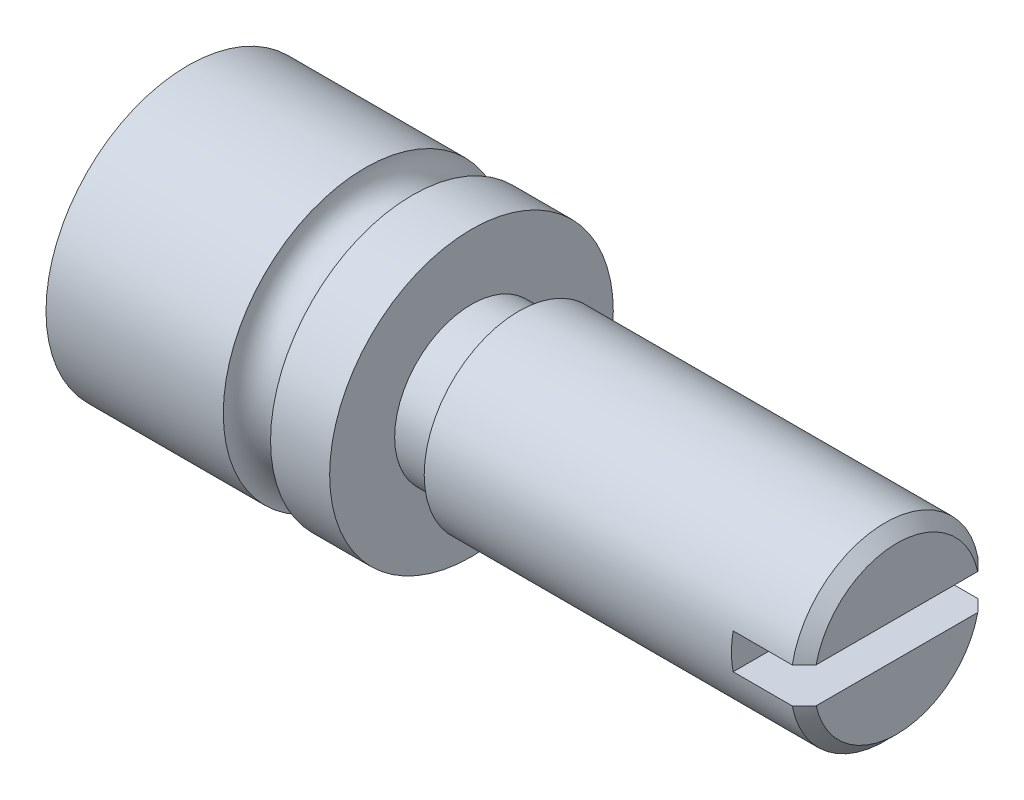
ISO-10303-21;
HEADER;
FILE_DESCRIPTION(('STEP AP214'),'2;1');
FILE_NAME('part.step','',(''),(''),'','','');
FILE_SCHEMA(('AUTOMOTIVE_DESIGN { 1 0 10303 214 1 1 1 1 }'));
ENDSEC;
DATA;
#1=APPLICATION_CONTEXT('core data for automotive mechanical design processes');
#2=APPLICATION_PROTOCOL_DEFINITION('international standard','automotive_design',2000,#1);
#3=PRODUCT_CONTEXT('',#1,'mechanical');
#4=PRODUCT('Part','Part','',(#3));
#5=PRODUCT_RELATED_PRODUCT_CATEGORY('part','',(#4));
#6=PRODUCT_DEFINITION_FORMATION('','',#4);
#7=PRODUCT_DEFINITION_CONTEXT('part definition',#1,'design');
#8=PRODUCT_DEFINITION('design','',#6,#7);
#9=PRODUCT_DEFINITION_SHAPE('','',#8);
#10=(LENGTH_UNIT() NAMED_UNIT(*) SI_UNIT(.MILLI.,.METRE.));
#11=(NAMED_UNIT(*) PLANE_ANGLE_UNIT() SI_UNIT($,.RADIAN.));
#12=(NAMED_UNIT(*) SI_UNIT($,.STERADIAN.) SOLID_ANGLE_UNIT());
#13=UNCERTAINTY_MEASURE_WITH_UNIT(LENGTH_MEASURE(1.E-05),#10,'distance_accuracy_value','');
#14=(GEOMETRIC_REPRESENTATION_CONTEXT(3) GLOBAL_UNCERTAINTY_ASSIGNED_CONTEXT((#13)) GLOBAL_UNIT_ASSIGNED_CONTEXT((#10,
#11,#12)) REPRESENTATION_CONTEXT('',''));
#15=CARTESIAN_POINT('',(0.,0.,0.));
#16=DIRECTION('',(0.,0.,1.));
#17=DIRECTION('',(1.,0.,0.));
#18=AXIS2_PLACEMENT_3D('',#15,#16,#17);
#19=CARTESIAN_POINT('',(18.,4.,0.));
#20=DIRECTION('',(-1.,0.,0.));
#21=DIRECTION('',(0.,0.,1.));
#22=AXIS2_PLACEMENT_3D('',#19,#20,#21);
#23=PLANE('',#22);
#24=CARTESIAN_POINT('',(18.,0.,0.));
#25=DIRECTION('',(-1.,0.,0.));
#26=DIRECTION('',(0.,0.,1.));
#27=AXIS2_PLACEMENT_3D('',#24,#25,#26);
#28=CIRCLE('',#27,3.50000000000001);
#29=CARTESIAN_POINT('',(18.,0.75,-3.41869858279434));
#30=VERTEX_POINT('',#29);
#31=CARTESIAN_POINT('',(18.,0.75,3.41869858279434));
#32=VERTEX_POINT('',#31);
#33=EDGE_CURVE('E143',#30,#32,#28,.F.);
#34=ORIENTED_EDGE('',*,*,#33,.T.);
#35=DIRECTION('',(0.,0.,-1.));
#36=VECTOR('',#35,1.);
#37=CARTESIAN_POINT('',(18.,0.75,0.));
#38=LINE('',#37,#36);
#39=EDGE_CURVE('E176',#32,#30,#38,.T.);
#40=ORIENTED_EDGE('',*,*,#39,.T.);
#41=EDGE_LOOP('',(#34,#40));
#42=FACE_BOUND('',#41,.T.);
#43=ADVANCED_FACE('F32',(#42),#23,.F.);
#44=CARTESIAN_POINT('',(17.5,0.,0.));
#45=DIRECTION('',(-1.,0.,0.));
#46=DIRECTION('',(0.,0.,1.));
#47=AXIS2_PLACEMENT_3D('',#44,#45,#46);
#48=CONICAL_SURFACE('',#47,4.,0.785398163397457);
#49=CARTESIAN_POINT('',(14.8204698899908,0.75,-6.63729029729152));
#50=CARTESIAN_POINT('',(15.0726824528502,0.75,-6.38345514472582));
#51=CARTESIAN_POINT('',(15.3248199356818,0.75,-6.12954521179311));
#52=CARTESIAN_POINT('',(15.8287436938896,0.75,-5.62154216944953));
#53=CARTESIAN_POINT('',(16.0805300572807,0.75,-5.36744914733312));
#54=CARTESIAN_POINT('',(16.583490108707,0.75,-4.85910839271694));
#55=CARTESIAN_POINT('',(16.8346641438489,0.75,-4.60486100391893));
#56=CARTESIAN_POINT('',(17.2109877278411,0.75,-4.22298317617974));
#57=CARTESIAN_POINT('',(17.3363748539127,0.75,-4.09558689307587));
#58=CARTESIAN_POINT('',(17.5869430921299,0.75,-3.84058302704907));
#59=CARTESIAN_POINT('',(17.7121241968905,0.75,-3.71297543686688));
#60=CARTESIAN_POINT('',(17.9624376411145,0.75,-3.45724382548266));
#61=CARTESIAN_POINT('',(18.0875694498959,0.75,-3.32911928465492));
#62=CARTESIAN_POINT('',(18.3374216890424,0.75,-3.07250094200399));
#63=CARTESIAN_POINT('',(18.4621421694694,0.75,-2.94400718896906));
#64=CARTESIAN_POINT('',(18.7108851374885,0.75,-2.68658876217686));
#65=CARTESIAN_POINT('',(18.8349081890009,0.75,-2.55766463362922));
#66=CARTESIAN_POINT('',(19.082137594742,0.75,-2.29892095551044));
#67=CARTESIAN_POINT('',(19.2053435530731,0.75,-2.16910102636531));
#68=CARTESIAN_POINT('',(19.3892670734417,0.75,-1.97311811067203));
#69=CARTESIAN_POINT('',(19.4505312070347,0.75,-1.90746844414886));
#70=CARTESIAN_POINT('',(19.5725543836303,0.75,-1.77571607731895));
#71=CARTESIAN_POINT('',(19.633313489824,0.75,-1.70961343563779));
#72=CARTESIAN_POINT('',(19.7540593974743,0.75,-1.57688540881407));
#73=CARTESIAN_POINT('',(19.8140472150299,0.75,-1.51026094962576));
#74=CARTESIAN_POINT('',(19.9330810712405,0.75,-1.37611643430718));
#75=CARTESIAN_POINT('',(19.9921266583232,0.75,-1.30859597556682));
#76=CARTESIAN_POINT('',(20.1090691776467,0.75,-1.17194139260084));
#77=CARTESIAN_POINT('',(20.1669583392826,0.75,-1.10280060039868));
#78=CARTESIAN_POINT('',(20.2803409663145,0.75,-0.962697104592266));
#79=CARTESIAN_POINT('',(20.335837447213,0.75,-0.891736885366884));
#80=CARTESIAN_POINT('',(20.4161754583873,0.75,-0.782796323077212));
#81=CARTESIAN_POINT('',(20.4425463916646,0.75,-0.745949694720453));
#82=CARTESIAN_POINT('',(20.4938284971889,0.75,-0.671283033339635));
#83=CARTESIAN_POINT('',(20.5187406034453,0.75,-0.633463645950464));
#84=CARTESIAN_POINT('',(20.5666567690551,0.75,-0.556369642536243));
#85=CARTESIAN_POINT('',(20.5896515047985,0.75,-0.517089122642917));
#86=CARTESIAN_POINT('',(20.6219376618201,0.75,-0.45692367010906));
#87=CARTESIAN_POINT('',(20.6323423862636,0.75,-0.43663783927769));
#88=CARTESIAN_POINT('',(20.6522451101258,0.75,-0.395612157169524));
#89=CARTESIAN_POINT('',(20.6617425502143,0.75,-0.374872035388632));
#90=CARTESIAN_POINT('',(20.6706997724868,0.75,-0.353891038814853));
#91=B_SPLINE_CURVE_WITH_KNOTS('',3,(#49,#50,#51,#52,#53,#54,#55,#56,#57,#58,#59,#60,#61,#62,#63,
#64,#65,#66,#67,#68,#69,#70,#71,#72,#73,#74,#75,#76,#77,#78,#79,#80,#81,#82,#83,#84,#85,#86,#87,
#88,#89,#90),.UNSPECIFIED.,.F.,.F.,(4,2,2,2,2,2,2,2,2,2,2,2,2,2,2,2,2,2,2,2,4),(0.,
1.07349499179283,2.14663819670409,3.21881794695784,3.75506930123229,4.29133947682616,
4.8286142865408,5.36582109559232,5.90250183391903,6.43942596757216,6.70880970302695,
6.97815920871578,7.24710726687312,7.51618056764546,7.78668361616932,8.05683513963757,
8.19274365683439,8.32856418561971,8.465010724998,8.53338611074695,8.60180338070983),.UNSPECIFIED.);
#92=CARTESIAN_POINT('',(17.5,0.75,-3.92905841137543));
#93=VERTEX_POINT('',#92);
#94=EDGE_CURVE('E106',#93,#30,#91,.T.);
#95=ORIENTED_EDGE('',*,*,#94,.F.);
#96=CARTESIAN_POINT('',(17.5,0.,0.));
#97=DIRECTION('',(-1.,0.,0.));
#98=DIRECTION('',(0.,0.,1.));
#99=AXIS2_PLACEMENT_3D('',#96,#97,#98);
#100=CIRCLE('',#99,4.);
#101=CARTESIAN_POINT('',(17.5,0.75,3.92905841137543));
#102=VERTEX_POINT('',#101);
#103=EDGE_CURVE('E147',#102,#93,#100,.T.);
#104=ORIENTED_EDGE('',*,*,#103,.F.);
#105=CARTESIAN_POINT('',(20.6706997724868,0.75,0.353891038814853));
#106=CARTESIAN_POINT('',(20.6583375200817,0.75,0.382818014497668));
#107=CARTESIAN_POINT('',(20.6449688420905,0.75,0.411286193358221));
#108=CARTESIAN_POINT('',(20.6166283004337,0.75,0.467374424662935));
#109=CARTESIAN_POINT('',(20.601658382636,0.75,0.494995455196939));
#110=CARTESIAN_POINT('',(20.5705517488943,0.75,0.549425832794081));
#111=CARTESIAN_POINT('',(20.5544196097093,0.75,0.576237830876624));
#112=CARTESIAN_POINT('',(20.5211968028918,0.75,0.629271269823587));
#113=CARTESIAN_POINT('',(20.5041058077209,0.75,0.655492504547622));
#114=CARTESIAN_POINT('',(20.4519036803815,0.75,0.733128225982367));
#115=CARTESIAN_POINT('',(20.4156933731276,0.75,0.783801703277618));
#116=CARTESIAN_POINT('',(20.3413482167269,0.75,0.88379009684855));
#117=CARTESIAN_POINT('',(20.303211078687,0.75,0.933103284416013));
#118=CARTESIAN_POINT('',(20.2262090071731,0.75,1.02999765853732));
#119=CARTESIAN_POINT('',(20.1873625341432,0.75,1.07759357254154));
#120=CARTESIAN_POINT('',(20.1087759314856,0.75,1.17204355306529));
#121=CARTESIAN_POINT('',(20.0690357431,0.75,1.21889757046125));
#122=CARTESIAN_POINT('',(19.9488290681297,0.75,1.35864354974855));
#123=CARTESIAN_POINT('',(19.8673926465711,0.75,1.45069954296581));
#124=CARTESIAN_POINT('',(19.7030172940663,0.75,1.63346776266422));
#125=CARTESIAN_POINT('',(19.6200781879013,0.75,1.72417983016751));
#126=CARTESIAN_POINT('',(19.4532473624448,0.75,1.90470047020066));
#127=CARTESIAN_POINT('',(19.3693557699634,0.75,1.99450916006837));
#128=CARTESIAN_POINT('',(19.2004629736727,0.75,2.17400447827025));
#129=CARTESIAN_POINT('',(19.1154582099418,0.75,2.26368774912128));
#130=CARTESIAN_POINT('',(18.9449802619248,0.75,2.44261314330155));
#131=CARTESIAN_POINT('',(18.8595070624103,0.75,2.53185525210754));
#132=CARTESIAN_POINT('',(18.6026214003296,0.75,2.79905907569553));
#133=CARTESIAN_POINT('',(18.4307060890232,0.75,2.97653713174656));
#134=CARTESIAN_POINT('',(18.1882611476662,0.75,3.22573707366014));
#135=CARTESIAN_POINT('',(18.1180532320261,0.75,3.2977730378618));
#136=CARTESIAN_POINT('',(17.9776326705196,0.75,3.44162998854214));
#137=CARTESIAN_POINT('',(17.9074201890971,0.75,3.51345113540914));
#138=CARTESIAN_POINT('',(17.5878474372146,0.75,3.83994586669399));
#139=CARTESIAN_POINT('',(17.3379780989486,0.75,4.09412103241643));
#140=CARTESIAN_POINT('',(16.8376178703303,0.75,4.60186117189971));
#141=CARTESIAN_POINT('',(16.5871269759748,0.75,4.85542614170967));
#142=CARTESIAN_POINT('',(16.0840900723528,0.75,5.36385746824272));
#143=CARTESIAN_POINT('',(15.831541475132,0.75,5.61872126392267));
#144=CARTESIAN_POINT('',(15.3261765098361,0.75,6.12817804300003));
#145=CARTESIAN_POINT('',(15.0733601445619,0.75,6.38277102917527));
#146=CARTESIAN_POINT('',(14.8204698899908,0.75,6.63729029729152));
#147=B_SPLINE_CURVE_WITH_KNOTS('',3,(#105,#106,#107,#108,#109,#110,#111,#112,#113,#114,#115,
#116,#117,#118,#119,#120,#121,#122,#123,#124,#125,#126,#127,#128,#129,#130,#131,#132,#133,#134,
#135,#136,#137,#138,#139,#140,#141,#142,#143,#144,#145,#146),.UNSPECIFIED.,.F.,.F.,(4,2,2,2,2,2,
2,2,2,2,2,2,2,2,2,2,2,2,2,2,4),(0.,0.0943161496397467,0.188518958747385,0.282369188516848,
0.376251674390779,0.563017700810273,0.750011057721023,0.934304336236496,1.11860976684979,
1.48729751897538,1.85602854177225,2.22471103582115,2.59541110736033,2.96612330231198,
3.70738720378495,4.00915700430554,4.31047501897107,5.37975152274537,6.44903493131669,
7.52543010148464,8.60181412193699),.UNSPECIFIED.);
#148=EDGE_CURVE('E107',#32,#102,#147,.T.);
#149=ORIENTED_EDGE('',*,*,#148,.F.);
#150=ORIENTED_EDGE('',*,*,#33,.F.);
#151=EDGE_LOOP('',(#95,#104,#149,#150));
#152=FACE_BOUND('',#151,.T.);
#153=ADVANCED_FACE('F186',(#152),#48,.T.);
#154=CARTESIAN_POINT('',(-90.6824561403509,0.,0.));
#155=DIRECTION('',(-1.,0.,0.));
#156=DIRECTION('',(0.,0.,1.));
#157=AXIS2_PLACEMENT_3D('',#154,#155,#156);
#158=CYLINDRICAL_SURFACE('',#157,6.);
#159=CARTESIAN_POINT('',(-2.49999999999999,0.,0.));
#160=DIRECTION('',(-1.,0.,0.));
#161=DIRECTION('',(0.,0.,1.));
#162=AXIS2_PLACEMENT_3D('',#159,#160,#161);
#163=CIRCLE('',#162,6.);
#164=CARTESIAN_POINT('',(-2.49999999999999,0.,6.));
#165=VERTEX_POINT('',#164);
#166=EDGE_CURVE('E151',#165,#165,#163,.T.);
#167=ORIENTED_EDGE('',*,*,#166,.F.);
#168=EDGE_LOOP('',(#167));
#169=FACE_BOUND('',#168,.T.);
#170=CARTESIAN_POINT('',(0.,0.,0.));
#171=DIRECTION('',(-1.,0.,0.));
#172=DIRECTION('',(0.,0.,1.));
#173=AXIS2_PLACEMENT_3D('',#170,#171,#172);
#174=CIRCLE('',#173,6.);
#175=CARTESIAN_POINT('',(0.,0.,6.));
#176=VERTEX_POINT('',#175);
#177=EDGE_CURVE('E171',#176,#176,#174,.T.);
#178=ORIENTED_EDGE('',*,*,#177,.T.);
#179=EDGE_LOOP('',(#178));
#180=FACE_BOUND('',#179,.T.);
#181=ADVANCED_FACE('F34',(#169,#180),#158,.T.);
#182=CARTESIAN_POINT('',(-3.49999999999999,0.,0.));
#183=DIRECTION('',(-1.,0.,0.));
#184=DIRECTION('',(0.,0.,1.));
#185=AXIS2_PLACEMENT_3D('',#182,#183,#184);
#186=TOROIDAL_SURFACE('',#185,6.,1.);
#187=CARTESIAN_POINT('',(-4.49999999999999,0.,0.));
#188=DIRECTION('',(-1.,0.,0.));
#189=DIRECTION('',(0.,0.,1.));
#190=AXIS2_PLACEMENT_3D('',#187,#188,#189);
#191=CIRCLE('',#190,6.);
#192=CARTESIAN_POINT('',(-4.49999999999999,0.,6.));
#193=VERTEX_POINT('',#192);
#194=EDGE_CURVE('E154',#193,#193,#191,.T.);
#195=ORIENTED_EDGE('',*,*,#194,.F.);
#196=EDGE_LOOP('',(#195));
#197=FACE_BOUND('',#196,.T.);
#198=ORIENTED_EDGE('',*,*,#166,.T.);
#199=EDGE_LOOP('',(#198));
#200=FACE_BOUND('',#199,.T.);
#201=ADVANCED_FACE('F215',(#197,#200),#186,.F.);
#202=CARTESIAN_POINT('',(-90.6824561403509,0.,0.));
#203=DIRECTION('',(-1.,0.,0.));
#204=DIRECTION('',(0.,0.,1.));
#205=AXIS2_PLACEMENT_3D('',#202,#203,#204);
#206=CYLINDRICAL_SURFACE('',#205,6.);
#207=CARTESIAN_POINT('',(-12.,0.,0.));
#208=DIRECTION('',(-1.,0.,0.));
#209=DIRECTION('',(0.,0.,1.));
#210=AXIS2_PLACEMENT_3D('',#207,#208,#209);
#211=CIRCLE('',#210,6.);
#212=CARTESIAN_POINT('',(-12.,0.,6.));
#213=VERTEX_POINT('',#212);
#214=EDGE_CURVE('E158',#213,#213,#211,.T.);
#215=ORIENTED_EDGE('',*,*,#214,.F.);
#216=EDGE_LOOP('',(#215));
#217=FACE_BOUND('',#216,.T.);
#218=ORIENTED_EDGE('',*,*,#194,.T.);
#219=EDGE_LOOP('',(#218));
#220=FACE_BOUND('',#219,.T.);
#221=ADVANCED_FACE('F210',(#217,#220),#206,.T.);
#222=CARTESIAN_POINT('',(4.99999999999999,0.,0.));
#223=DIRECTION('',(-1.,0.,0.));
#224=DIRECTION('',(0.,1.,0.));
#225=AXIS2_PLACEMENT_3D('',#222,#223,#224);
#226=SPHERICAL_SURFACE('',#225,18.0277563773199);
#227=ORIENTED_EDGE('',*,*,#214,.T.);
#228=EDGE_LOOP('',(#227));
#229=FACE_BOUND('',#228,.T.);
#230=ADVANCED_FACE('F204',(#229),#226,.T.);
#231=CARTESIAN_POINT('',(18.,-0.75,3.41869858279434));
#232=VERTEX_POINT('',#231);
#233=CARTESIAN_POINT('',(18.,-0.75,-3.41869858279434));
#234=VERTEX_POINT('',#233);
#235=EDGE_CURVE('E140',#232,#234,#28,.F.);
#236=ORIENTED_EDGE('',*,*,#235,.T.);
#237=DIRECTION('',(0.,0.,1.));
#238=VECTOR('',#237,1.);
#239=CARTESIAN_POINT('',(18.,-0.75,0.));
#240=LINE('',#239,#238);
#241=EDGE_CURVE('E96',#234,#232,#240,.T.);
#242=ORIENTED_EDGE('',*,*,#241,.T.);
#243=EDGE_LOOP('',(#236,#242));
#244=FACE_BOUND('',#243,.T.);
#245=ADVANCED_FACE('F198',(#244),#23,.F.);
#246=CARTESIAN_POINT('',(-90.6824561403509,0.,0.));
#247=DIRECTION('',(-1.,0.,0.));
#248=DIRECTION('',(0.,0.,1.));
#249=AXIS2_PLACEMENT_3D('',#246,#247,#248);
#250=CYLINDRICAL_SURFACE('',#249,4.);
#251=CARTESIAN_POINT('',(15.,0.,0.));
#252=DIRECTION('',(-1.,0.,0.));
#253=DIRECTION('',(0.,0.,1.));
#254=AXIS2_PLACEMENT_3D('',#251,#252,#253);
#255=CIRCLE('',#254,4.);
#256=CARTESIAN_POINT('',(15.,-0.75,3.92905841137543));
#257=VERTEX_POINT('',#256);
#258=CARTESIAN_POINT('',(15.,0.75,3.92905841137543));
#259=VERTEX_POINT('',#258);
#260=EDGE_CURVE('E11',#257,#259,#255,.T.);
#261=ORIENTED_EDGE('',*,*,#260,.T.);
#262=DIRECTION('',(-1.,0.,0.));
#263=VECTOR('',#262,1.);
#264=CARTESIAN_POINT('',(-90.6824561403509,0.75,3.92905841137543));
#265=LINE('',#264,#263);
#266=EDGE_CURVE('E95',#259,#102,#265,.F.);
#267=ORIENTED_EDGE('',*,*,#266,.T.);
#268=ORIENTED_EDGE('',*,*,#103,.T.);
#269=DIRECTION('',(-1.,0.,0.));
#270=VECTOR('',#269,1.);
#271=CARTESIAN_POINT('',(-90.6824561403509,0.75,-3.92905841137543));
#272=LINE('',#271,#270);
#273=CARTESIAN_POINT('',(15.,0.75,-3.92905841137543));
#274=VERTEX_POINT('',#273);
#275=EDGE_CURVE('E55',#93,#274,#272,.T.);
#276=ORIENTED_EDGE('',*,*,#275,.T.);
#277=CARTESIAN_POINT('',(15.,-0.75,-3.92905841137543));
#278=VERTEX_POINT('',#277);
#279=EDGE_CURVE('E36',#274,#278,#255,.T.);
#280=ORIENTED_EDGE('',*,*,#279,.T.);
#281=DIRECTION('',(-1.,0.,0.));
#282=VECTOR('',#281,1.);
#283=CARTESIAN_POINT('',(-90.6824561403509,-0.75,-3.92905841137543));
#284=LINE('',#283,#282);
#285=CARTESIAN_POINT('',(17.5,-0.75,-3.92905841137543));
#286=VERTEX_POINT('',#285);
#287=EDGE_CURVE('E85',#278,#286,#284,.F.);
#288=ORIENTED_EDGE('',*,*,#287,.T.);
#289=CARTESIAN_POINT('',(17.5,-0.75,3.92905841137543));
#290=VERTEX_POINT('',#289);
#291=EDGE_CURVE('E150',#286,#290,#100,.T.);
#292=ORIENTED_EDGE('',*,*,#291,.T.);
#293=DIRECTION('',(-1.,0.,0.));
#294=VECTOR('',#293,1.);
#295=CARTESIAN_POINT('',(-90.6824561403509,-0.75,3.92905841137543));
#296=LINE('',#295,#294);
#297=EDGE_CURVE('E47',#290,#257,#296,.T.);
#298=ORIENTED_EDGE('',*,*,#297,.T.);
#299=EDGE_LOOP('',(#261,#267,#268,#276,#280,#288,#292,#298));
#300=FACE_BOUND('',#299,.T.);
#301=CARTESIAN_POINT('',(2.,0.,0.));
#302=DIRECTION('',(-1.,0.,0.));
#303=DIRECTION('',(0.,0.,1.));
#304=AXIS2_PLACEMENT_3D('',#301,#302,#303);
#305=CIRCLE('',#304,4.);
#306=CARTESIAN_POINT('',(2.,0.,4.));
#307=VERTEX_POINT('',#306);
#308=EDGE_CURVE('E162',#307,#307,#305,.T.);
#309=ORIENTED_EDGE('',*,*,#308,.F.);
#310=EDGE_LOOP('',(#309));
#311=FACE_BOUND('',#310,.T.);
#312=ADVANCED_FACE('F103',(#300,#311),#250,.T.);
#313=CARTESIAN_POINT('',(2.,3.25,0.));
#314=DIRECTION('',(1.,0.,0.));
#315=DIRECTION('',(0.,0.,-1.));
#316=AXIS2_PLACEMENT_3D('',#313,#314,#315);
#317=PLANE('',#316);
#318=CARTESIAN_POINT('',(2.,0.,0.));
#319=DIRECTION('',(-1.,0.,0.));
#320=DIRECTION('',(0.,0.,1.));
#321=AXIS2_PLACEMENT_3D('',#318,#319,#320);
#322=CIRCLE('',#321,3.25);
#323=CARTESIAN_POINT('',(2.,0.,3.25));
#324=VERTEX_POINT('',#323);
#325=EDGE_CURVE('E165',#324,#324,#322,.T.);
#326=ORIENTED_EDGE('',*,*,#325,.F.);
#327=EDGE_LOOP('',(#326));
#328=FACE_BOUND('',#327,.T.);
#329=ORIENTED_EDGE('',*,*,#308,.T.);
#330=EDGE_LOOP('',(#329));
#331=FACE_BOUND('',#330,.T.);
#332=ADVANCED_FACE('F209',(#328,#331),#317,.F.);
#333=CARTESIAN_POINT('',(-90.6824561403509,0.,0.));
#334=DIRECTION('',(-1.,0.,0.));
#335=DIRECTION('',(0.,0.,1.));
#336=AXIS2_PLACEMENT_3D('',#333,#334,#335);
#337=CYLINDRICAL_SURFACE('',#336,3.25);
#338=CARTESIAN_POINT('',(0.,0.,0.));
#339=DIRECTION('',(-1.,0.,0.));
#340=DIRECTION('',(0.,0.,1.));
#341=AXIS2_PLACEMENT_3D('',#338,#339,#340);
#342=CIRCLE('',#341,3.25);
#343=CARTESIAN_POINT('',(0.,0.,3.25));
#344=VERTEX_POINT('',#343);
#345=EDGE_CURVE('E168',#344,#344,#342,.T.);
#346=ORIENTED_EDGE('',*,*,#345,.F.);
#347=EDGE_LOOP('',(#346));
#348=FACE_BOUND('',#347,.T.);
#349=ORIENTED_EDGE('',*,*,#325,.T.);
#350=EDGE_LOOP('',(#349));
#351=FACE_BOUND('',#350,.T.);
#352=ADVANCED_FACE('F191',(#348,#351),#337,.T.);
#353=CARTESIAN_POINT('',(0.,6.,0.));
#354=DIRECTION('',(-1.,0.,0.));
#355=DIRECTION('',(0.,0.,1.));
#356=AXIS2_PLACEMENT_3D('',#353,#354,#355);
#357=PLANE('',#356);
#358=ORIENTED_EDGE('',*,*,#177,.F.);
#359=EDGE_LOOP('',(#358));
#360=FACE_BOUND('',#359,.T.);
#361=ORIENTED_EDGE('',*,*,#345,.T.);
#362=EDGE_LOOP('',(#361));
#363=FACE_BOUND('',#362,.T.);
#364=ADVANCED_FACE('F185',(#360,#363),#357,.F.);
#365=CARTESIAN_POINT('',(20.6706997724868,-0.75,-0.353891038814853));
#366=CARTESIAN_POINT('',(20.6583375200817,-0.75,-0.382818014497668));
#367=CARTESIAN_POINT('',(20.6449688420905,-0.75,-0.411286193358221));
#368=CARTESIAN_POINT('',(20.6166283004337,-0.75,-0.467374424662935));
#369=CARTESIAN_POINT('',(20.601658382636,-0.75,-0.494995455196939));
#370=CARTESIAN_POINT('',(20.5705517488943,-0.75,-0.549425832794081));
#371=CARTESIAN_POINT('',(20.5544196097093,-0.75,-0.576237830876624));
#372=CARTESIAN_POINT('',(20.5211968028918,-0.75,-0.629271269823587));
#373=CARTESIAN_POINT('',(20.5041058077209,-0.75,-0.655492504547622));
#374=CARTESIAN_POINT('',(20.4519036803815,-0.75,-0.733128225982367));
#375=CARTESIAN_POINT('',(20.4156933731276,-0.75,-0.783801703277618));
#376=CARTESIAN_POINT('',(20.3413482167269,-0.75,-0.88379009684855));
#377=CARTESIAN_POINT('',(20.303211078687,-0.75,-0.933103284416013));
#378=CARTESIAN_POINT('',(20.2262090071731,-0.75,-1.02999765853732));
#379=CARTESIAN_POINT('',(20.1873625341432,-0.75,-1.07759357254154));
#380=CARTESIAN_POINT('',(20.1087759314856,-0.75,-1.17204355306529));
#381=CARTESIAN_POINT('',(20.0690357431,-0.75,-1.21889757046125));
#382=CARTESIAN_POINT('',(19.9488290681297,-0.75,-1.35864354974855));
#383=CARTESIAN_POINT('',(19.8673926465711,-0.75,-1.45069954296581));
#384=CARTESIAN_POINT('',(19.7030172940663,-0.75,-1.63346776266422));
#385=CARTESIAN_POINT('',(19.6200781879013,-0.75,-1.72417983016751));
#386=CARTESIAN_POINT('',(19.4532473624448,-0.75,-1.90470047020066));
#387=CARTESIAN_POINT('',(19.3693557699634,-0.75,-1.99450916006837));
#388=CARTESIAN_POINT('',(19.2004629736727,-0.75,-2.17400447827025));
#389=CARTESIAN_POINT('',(19.1154582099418,-0.75,-2.26368774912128));
#390=CARTESIAN_POINT('',(18.9449802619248,-0.75,-2.44261314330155));
#391=CARTESIAN_POINT('',(18.8595070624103,-0.75,-2.53185525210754));
#392=CARTESIAN_POINT('',(18.6026214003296,-0.75,-2.79905907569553));
#393=CARTESIAN_POINT('',(18.4307060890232,-0.75,-2.97653713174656));
#394=CARTESIAN_POINT('',(18.1882611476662,-0.75,-3.22573707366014));
#395=CARTESIAN_POINT('',(18.1180532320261,-0.75,-3.2977730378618));
#396=CARTESIAN_POINT('',(17.9776326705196,-0.75,-3.44162998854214));
#397=CARTESIAN_POINT('',(17.9074201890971,-0.75,-3.51345113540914));
#398=CARTESIAN_POINT('',(17.5878474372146,-0.75,-3.83994586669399));
#399=CARTESIAN_POINT('',(17.3379780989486,-0.75,-4.09412103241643));
#400=CARTESIAN_POINT('',(16.8376178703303,-0.75,-4.60186117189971));
#401=CARTESIAN_POINT('',(16.5871269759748,-0.75,-4.85542614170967));
#402=CARTESIAN_POINT('',(16.0840900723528,-0.75,-5.36385746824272));
#403=CARTESIAN_POINT('',(15.831541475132,-0.75,-5.61872126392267));
#404=CARTESIAN_POINT('',(15.3261765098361,-0.75,-6.12817804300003));
#405=CARTESIAN_POINT('',(15.0733601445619,-0.75,-6.38277102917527));
#406=CARTESIAN_POINT('',(14.8204698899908,-0.75,-6.63729029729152));
#407=B_SPLINE_CURVE_WITH_KNOTS('',3,(#365,#366,#367,#368,#369,#370,#371,#372,#373,#374,#375,
#376,#377,#378,#379,#380,#381,#382,#383,#384,#385,#386,#387,#388,#389,#390,#391,#392,#393,#394,
#395,#396,#397,#398,#399,#400,#401,#402,#403,#404,#405,#406),.UNSPECIFIED.,.F.,.F.,(4,2,2,2,2,2,
2,2,2,2,2,2,2,2,2,2,2,2,2,2,4),(0.,0.0943161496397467,0.188518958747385,0.282369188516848,
0.376251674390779,0.563017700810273,0.750011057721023,0.934304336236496,1.11860976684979,
1.48729751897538,1.85602854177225,2.22471103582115,2.59541110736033,2.96612330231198,
3.70738720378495,4.00915700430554,4.31047501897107,5.37975152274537,6.44903493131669,
7.52543010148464,8.60181412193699),.UNSPECIFIED.);
#408=EDGE_CURVE('E90',#234,#286,#407,.T.);
#409=ORIENTED_EDGE('',*,*,#408,.F.);
#410=ORIENTED_EDGE('',*,*,#235,.F.);
#411=CARTESIAN_POINT('',(14.8204698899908,-0.75,6.63729029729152));
#412=CARTESIAN_POINT('',(15.0726824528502,-0.75,6.38345514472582));
#413=CARTESIAN_POINT('',(15.3248199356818,-0.75,6.12954521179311));
#414=CARTESIAN_POINT('',(15.8287436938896,-0.75,5.62154216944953));
#415=CARTESIAN_POINT('',(16.0805300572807,-0.75,5.36744914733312));
#416=CARTESIAN_POINT('',(16.583490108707,-0.75,4.85910839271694));
#417=CARTESIAN_POINT('',(16.8346641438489,-0.75,4.60486100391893));
#418=CARTESIAN_POINT('',(17.2109877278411,-0.75,4.22298317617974));
#419=CARTESIAN_POINT('',(17.3363748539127,-0.75,4.09558689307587));
#420=CARTESIAN_POINT('',(17.5869430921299,-0.75,3.84058302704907));
#421=CARTESIAN_POINT('',(17.7121241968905,-0.75,3.71297543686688));
#422=CARTESIAN_POINT('',(17.9624376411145,-0.75,3.45724382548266));
#423=CARTESIAN_POINT('',(18.0875694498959,-0.75,3.32911928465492));
#424=CARTESIAN_POINT('',(18.3374216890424,-0.75,3.07250094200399));
#425=CARTESIAN_POINT('',(18.4621421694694,-0.75,2.94400718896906));
#426=CARTESIAN_POINT('',(18.7108851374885,-0.75,2.68658876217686));
#427=CARTESIAN_POINT('',(18.8349081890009,-0.75,2.55766463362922));
#428=CARTESIAN_POINT('',(19.082137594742,-0.75,2.29892095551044));
#429=CARTESIAN_POINT('',(19.2053435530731,-0.75,2.16910102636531));
#430=CARTESIAN_POINT('',(19.3892670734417,-0.75,1.97311811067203));
#431=CARTESIAN_POINT('',(19.4505312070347,-0.75,1.90746844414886));
#432=CARTESIAN_POINT('',(19.5725543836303,-0.75,1.77571607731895));
#433=CARTESIAN_POINT('',(19.633313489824,-0.75,1.70961343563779));
#434=CARTESIAN_POINT('',(19.7540593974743,-0.75,1.57688540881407));
#435=CARTESIAN_POINT('',(19.8140472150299,-0.75,1.51026094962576));
#436=CARTESIAN_POINT('',(19.9330810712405,-0.75,1.37611643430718));
#437=CARTESIAN_POINT('',(19.9921266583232,-0.75,1.30859597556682));
#438=CARTESIAN_POINT('',(20.1090691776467,-0.75,1.17194139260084));
#439=CARTESIAN_POINT('',(20.1669583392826,-0.75,1.10280060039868));
#440=CARTESIAN_POINT('',(20.2803409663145,-0.75,0.962697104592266));
#441=CARTESIAN_POINT('',(20.335837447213,-0.75,0.891736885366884));
#442=CARTESIAN_POINT('',(20.4161754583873,-0.75,0.782796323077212));
#443=CARTESIAN_POINT('',(20.4425463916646,-0.75,0.745949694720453));
#444=CARTESIAN_POINT('',(20.4938284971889,-0.75,0.671283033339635));
#445=CARTESIAN_POINT('',(20.5187406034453,-0.75,0.633463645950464));
#446=CARTESIAN_POINT('',(20.5666567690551,-0.75,0.556369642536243));
#447=CARTESIAN_POINT('',(20.5896515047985,-0.75,0.517089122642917));
#448=CARTESIAN_POINT('',(20.6219376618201,-0.75,0.45692367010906));
#449=CARTESIAN_POINT('',(20.6323423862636,-0.75,0.43663783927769));
#450=CARTESIAN_POINT('',(20.6522451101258,-0.75,0.395612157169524));
#451=CARTESIAN_POINT('',(20.6617425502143,-0.75,0.374872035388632));
#452=CARTESIAN_POINT('',(20.6706997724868,-0.75,0.353891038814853));
#453=B_SPLINE_CURVE_WITH_KNOTS('',3,(#411,#412,#413,#414,#415,#416,#417,#418,#419,#420,#421,
#422,#423,#424,#425,#426,#427,#428,#429,#430,#431,#432,#433,#434,#435,#436,#437,#438,#439,#440,
#441,#442,#443,#444,#445,#446,#447,#448,#449,#450,#451,#452),.UNSPECIFIED.,.F.,.F.,(4,2,2,2,2,2,
2,2,2,2,2,2,2,2,2,2,2,2,2,2,4),(0.,1.07349499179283,2.14663819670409,3.21881794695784,
3.75506930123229,4.29133947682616,4.8286142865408,5.36582109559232,5.90250183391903,
6.43942596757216,6.70880970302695,6.97815920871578,7.24710726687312,7.51618056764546,
7.78668361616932,8.05683513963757,8.19274365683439,8.32856418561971,8.465010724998,
8.53338611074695,8.60180338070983),.UNSPECIFIED.);
#454=EDGE_CURVE('E132',#290,#232,#453,.T.);
#455=ORIENTED_EDGE('',*,*,#454,.F.);
#456=ORIENTED_EDGE('',*,*,#291,.F.);
#457=EDGE_LOOP('',(#409,#410,#455,#456));
#458=FACE_BOUND('',#457,.T.);
#459=ADVANCED_FACE('F119',(#458),#48,.T.);
#460=CARTESIAN_POINT('',(15.,0.75,-5.));
#461=DIRECTION('',(-1.,0.,0.));
#462=DIRECTION('',(0.,0.,1.));
#463=AXIS2_PLACEMENT_3D('',#460,#461,#462);
#464=PLANE('',#463);
#465=DIRECTION('',(0.,0.,1.));
#466=VECTOR('',#465,1.);
#467=CARTESIAN_POINT('',(15.,0.75,-5.));
#468=LINE('',#467,#466);
#469=EDGE_CURVE('E101',#274,#259,#468,.T.);
#470=ORIENTED_EDGE('',*,*,#469,.T.);
#471=ORIENTED_EDGE('',*,*,#260,.F.);
#472=DIRECTION('',(0.,0.,1.));
#473=VECTOR('',#472,1.);
#474=CARTESIAN_POINT('',(15.,-0.75,-5.));
#475=LINE('',#474,#473);
#476=EDGE_CURVE('E88',#278,#257,#475,.T.);
#477=ORIENTED_EDGE('',*,*,#476,.F.);
#478=ORIENTED_EDGE('',*,*,#279,.F.);
#479=EDGE_LOOP('',(#470,#471,#477,#478));
#480=FACE_BOUND('',#479,.T.);
#481=ADVANCED_FACE('F100',(#480),#464,.F.);
#482=CARTESIAN_POINT('',(15.,0.75,-5.));
#483=DIRECTION('',(0.,1.,0.));
#484=DIRECTION('',(0.,0.,1.));
#485=AXIS2_PLACEMENT_3D('',#482,#483,#484);
#486=PLANE('',#485);
#487=ORIENTED_EDGE('',*,*,#94,.T.);
#488=ORIENTED_EDGE('',*,*,#39,.F.);
#489=ORIENTED_EDGE('',*,*,#148,.T.);
#490=ORIENTED_EDGE('',*,*,#266,.F.);
#491=ORIENTED_EDGE('',*,*,#469,.F.);
#492=ORIENTED_EDGE('',*,*,#275,.F.);
#493=EDGE_LOOP('',(#487,#488,#489,#490,#491,#492));
#494=FACE_BOUND('',#493,.T.);
#495=ADVANCED_FACE('F123',(#494),#486,.F.);
#496=CARTESIAN_POINT('',(15.,-0.75,-5.));
#497=DIRECTION('',(0.,-1.,0.));
#498=DIRECTION('',(0.,0.,-1.));
#499=AXIS2_PLACEMENT_3D('',#496,#497,#498);
#500=PLANE('',#499);
#501=ORIENTED_EDGE('',*,*,#476,.T.);
#502=ORIENTED_EDGE('',*,*,#297,.F.);
#503=ORIENTED_EDGE('',*,*,#454,.T.);
#504=ORIENTED_EDGE('',*,*,#241,.F.);
#505=ORIENTED_EDGE('',*,*,#408,.T.);
#506=ORIENTED_EDGE('',*,*,#287,.F.);
#507=EDGE_LOOP('',(#501,#502,#503,#504,#505,#506));
#508=FACE_BOUND('',#507,.T.);
#509=ADVANCED_FACE('F87',(#508),#500,.F.);
#510=CLOSED_SHELL('',(#43,#153,#181,#201,#221,#230,#245,#312,#332,#352,#364,#459,#481,#495,#509));
#511=MANIFOLD_SOLID_BREP('B2',#510);
#512=ADVANCED_BREP_SHAPE_REPRESENTATION('',(#18,#511),#14);
#513=SHAPE_DEFINITION_REPRESENTATION(#9,#512);
ENDSEC;
END-ISO-10303-21;
